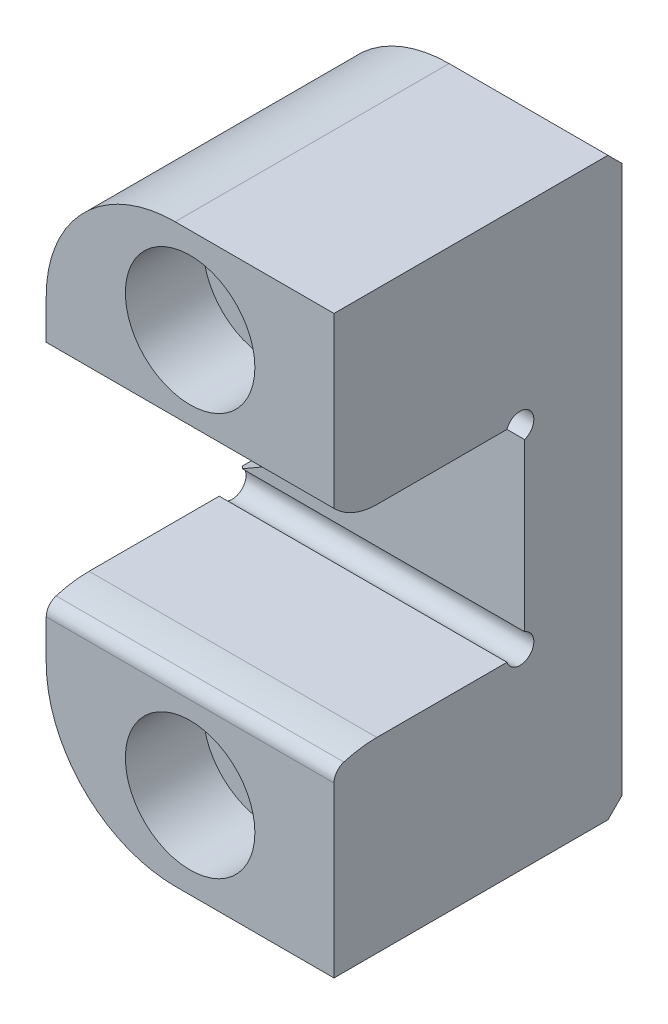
from build123d import *

# Parameters (mm, degrees)
EXTRUDE1_DEPTH        = 7.9375
FILLET1_R             = 7.112
CUT_EXTRUDE1_DEPTH    = 28.49630657
CUT_EXTRUDE2_DEPTH    = 28.49630657
SKETCH6_R             = 0.762
CUT_EXTRUDE3_DEPTH    = 28.49630657
F_6_CBORE_D           = 4.3053
F_6_CBORE_CBORE_D     = 7.14502
F_6_CBORE_CBORE_DEPTH = 4.30022
CHAMFER3_SIZE         = 3.81
CHAMFER3_SIZE2        = 1.020886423
CHAMFER1_SIZE         = 0.762


with BuildPart() as part:
    # Sketch1 → Extrude1 (new, symmetric)
    with BuildSketch(Plane(origin=(0, 0, 0), x_dir=(0, 0, -1), z_dir=(1, 0, 0))):
        Polygon((0, 5.5626), (10.5156, 5.5626), (10.5156, -5.5626), (0, -5.5626), (0, -15.875), (15.875, -15.875), (15.875, 15.875), (0, 15.875), align=None)
    extrude(amount=EXTRUDE1_DEPTH, both=True)

    # Fillet1
    fillet1_edges = [part.edges().sort_by_distance(p)[0] for p in [
        (-7.9375, 15.875, -7.9375),
        (-7.9375, -15.875, -7.9375),
    ]]
    fillet(fillet1_edges, radius=FILLET1_R)

    # Sketch2 → Cut-Extrude1 (cut, through all)
    with BuildSketch(Plane(origin=(-7.9375, 0, -15.875), x_dir=(1, 0, 0), z_dir=(0, 0, 1))):
        Polygon((-1.5875, 5.679043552), (-1.5875, -5.679043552), (1.5875, -3.845956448), (1.5875, 3.845956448), align=None)
    extrude(amount=CUT_EXTRUDE1_DEPTH, mode=Mode.SUBTRACT)

    # Sketch5 → Cut-Extrude2 (cut, through all)
    with BuildSketch(Plane(origin=(7.9375, 0, 0), x_dir=(0, 0, -1), z_dir=(1, 0, 0))):
        with BuildLine():
            Line((-3.9878, -3.383619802), (2.3622, -3.383619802))
            Line((2.3622, -3.383619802), (2.3622, -5.5626))
            ThreePointArc((2.3622, -5.5626), (1.44332416, -5.62943462), (0.543790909, -5.828531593))
            ThreePointArc((0.543790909, -5.828531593), (0.150886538, -6.103444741), (0, -6.558619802))
            Line((0, -6.558619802), (-3.9878, -6.558619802))
            Line((-3.9878, -6.558619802), (-3.9878, -3.383619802))
        make_face()
        with BuildLine():
            Line((2.3622, 3.383619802), (2.3622, 5.5626))
            ThreePointArc((2.3622, 5.5626), (1.080400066, 5.82178595), (0, 6.558619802))
            Line((0, 6.558619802), (-3.9878, 6.558619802))
            Line((-3.9878, 6.558619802), (-3.9878, 3.383619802))
            Line((-3.9878, 3.383619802), (2.3622, 3.383619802))
        make_face()
    extrude(amount=-CUT_EXTRUDE2_DEPTH, mode=Mode.SUBTRACT)

    # Sketch6 → Cut-Extrude3 (cut, through all)
    with BuildSketch(Plane(origin=(7.9375, 0, 0), x_dir=(0, 0, -1), z_dir=(1, 0, 0))):
        with Locations((10.2616, 5.3086)):
            Circle(SKETCH6_R)
        with Locations((10.2616, -5.3086)):
            Circle(SKETCH6_R)
    extrude(amount=-CUT_EXTRUDE3_DEPTH, mode=Mode.SUBTRACT)

    # 6 CBORE (through all)
    with Locations(Plane.XY):
        with Locations((0, 11.1125), (0, -11.1125)):
            CounterBoreHole(F_6_CBORE_D / 2, F_6_CBORE_CBORE_D / 2, F_6_CBORE_CBORE_DEPTH)

    # Chamfer3
    chamfer3_edges = [part.edges().sort_by_distance(p)[0] for p in [
        (-6.35, 0, -10.5156),
    ]]
    chamfer3_side = [part.faces().sort_by_distance(p)[0] for p in [
        (-6.35, 0, -13.1953),
    ]]
    chamfer(chamfer3_edges, length=CHAMFER3_SIZE, length2=CHAMFER3_SIZE2, reference=chamfer3_side[0])

    # Chamfer1
    chamfer1_edges = [part.edges().sort_by_distance(p)[0] for p in [
        (3.556, 15.875, -15.875),
        (3.556, -15.875, -15.875),
        (-7.9375, -6.76275, -15.875),
        (-5.854443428, 13.791943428, -15.875),
        (-5.854443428, -13.791943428, -15.875),
        (-7.9375, 6.76275, -15.875),
    ]]
    chamfer(chamfer1_edges, length=CHAMFER1_SIZE)


solid = part.part
